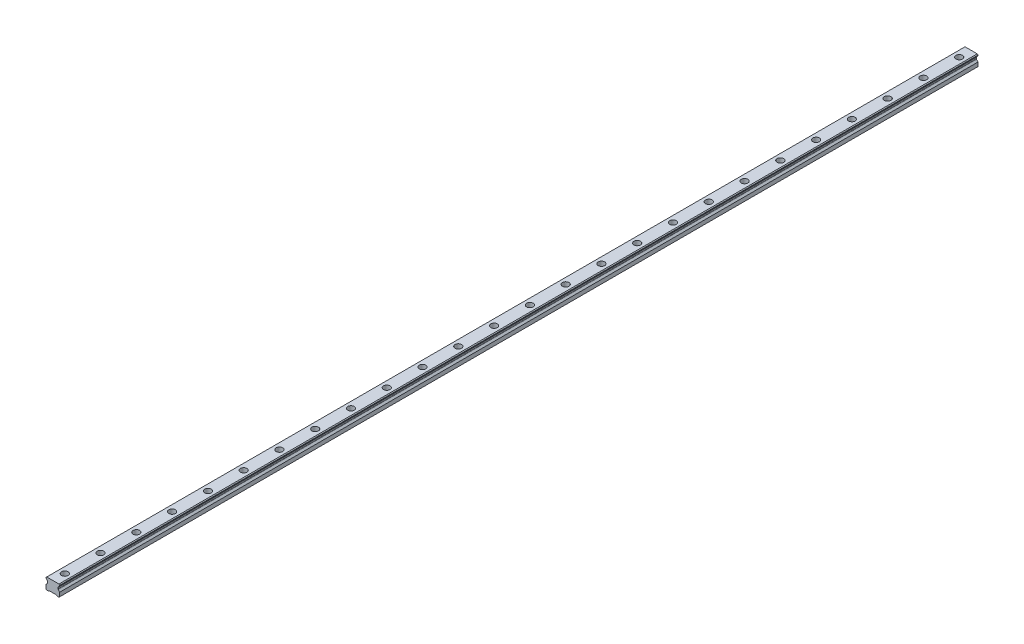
from build123d import *

# Parameters (mm, degrees)
SKETCH1_W           = 23
SKETCH1_H           = 19.2
BOSS_EXTRUDE1_DEPTH = 770
CUT_EXTRUDE1_DEPTH  = 1541.162618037
CHAMFER1_SIZE       = 1.25
FILLET1_R           = 1.25
CUT_EXTRUDE2_DEPTH  = 1541.162618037
SKETCH4_R           = 5.5
SKETCH4_R_2         = 3.5
CUT_EXTRUDE3_DEPTH  = 9
SKETCH4_2_R         = 3.5
CUT_EXTRUDE4_DEPTH  = 771.325184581
LPATTERN1_COUNT     = 26
LPATTERN1_PITCH     = 60


with BuildPart() as part:
    # Sketch1 → Boss-Extrude1 (new, symmetric)
    with BuildSketch(Plane.XY):
        with Locations((0, 9.6)):
            Rectangle(SKETCH1_W, SKETCH1_H)
    extrude(amount=BOSS_EXTRUDE1_DEPTH, both=True)

    # Sketch2 → Cut-Extrude1 (cut, through all)
    with BuildSketch(Plane.XY.offset(770)):
        Polygon((-11.5, 16.7), (-11.5, 7.95), (-8.583333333, 10.866666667), (-8.583333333, 13.783333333), align=None)
        Polygon((8.583333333, 13.783333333), (11.5, 16.7), (11.5, 7.95), (8.583333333, 10.866666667), align=None)
    extrude(amount=-CUT_EXTRUDE1_DEPTH, mode=Mode.SUBTRACT)

    # Chamfer1
    chamfer1_edges = [part.edges().sort_by_distance(p)[0] for p in [
        (-11.5, 19.2, 0),
        (11.5, 19.2, 0),
        (11.5, 0, 0),
        (-11.5, 0, 0),
    ]]
    chamfer(chamfer1_edges, length=CHAMFER1_SIZE)

    # Fillet1
    fillet1_edges = [part.edges().sort_by_distance(p)[0] for p in [
        (-8.583333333, 13.783333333, 0),
        (-8.583333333, 10.866666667, 0),
        (8.583333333, 10.866666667, 0),
        (8.583333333, 13.783333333, 0),
    ]]
    fillet(fillet1_edges, radius=FILLET1_R)

    # Sketch3 → Cut-Extrude2 (cut, through all)
    with BuildSketch(Plane.XY.offset(770)):
        Polygon((-7, 0), (-5.75, 1.25), (5.75, 1.25), (7, 0), align=None)
    extrude(amount=-CUT_EXTRUDE2_DEPTH, mode=Mode.SUBTRACT)

    # Sketch4 → Cut-Extrude3 (cut)
    with BuildSketch(Plane(origin=(0, 19.2, 0), x_dir=(1, 0, 0), z_dir=(0, 1, 0))):
        with Locations(Location((0, -750, 0), (0, 0, 270))):
            Circle(SKETCH4_R)
        with Locations(Location((0, -750, 0), (0, 0, 270))):
            Circle(SKETCH4_R_2, mode=Mode.SUBTRACT)
    cut_extrude3 = extrude(amount=-CUT_EXTRUDE3_DEPTH, mode=Mode.SUBTRACT)

    # Sketch4_2 → Cut-Extrude4 (cut, through all)
    with BuildSketch(Plane(origin=(0, 19.2, 0), x_dir=(1, 0, 0), z_dir=(0, 1, 0))):
        with Locations(Location((0, -750, 0), (0, 0, 270))):
            Circle(SKETCH4_2_R)
    cut_extrude4 = extrude(amount=-CUT_EXTRUDE4_DEPTH, mode=Mode.SUBTRACT)

    # LPattern1: Cut-Extrude3, Cut-Extrude4 ×26
    with Locations(*[(0, 0, -i * LPATTERN1_PITCH) for i in range(1, LPATTERN1_COUNT)]):
        add(cut_extrude3, mode=Mode.SUBTRACT)
        add(cut_extrude4, mode=Mode.SUBTRACT)


solid = part.part
